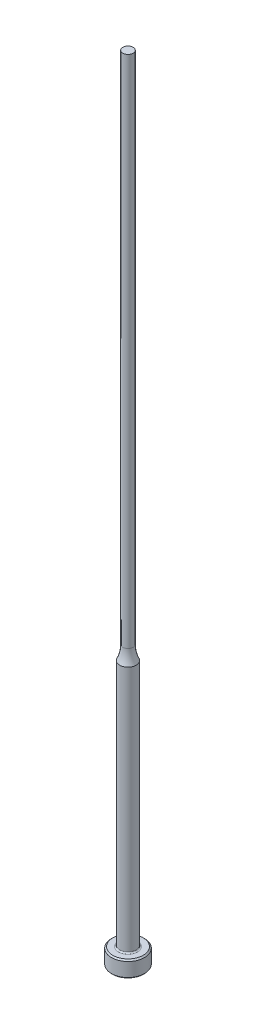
ISO-10303-21;
HEADER;
FILE_DESCRIPTION(('STEP AP214'),'2;1');
FILE_NAME('part.step','',(''),(''),'','','');
FILE_SCHEMA(('AUTOMOTIVE_DESIGN { 1 0 10303 214 1 1 1 1 }'));
ENDSEC;
DATA;
#1=APPLICATION_CONTEXT('core data for automotive mechanical design processes');
#2=APPLICATION_PROTOCOL_DEFINITION('international standard','automotive_design',2000,#1);
#3=PRODUCT_CONTEXT('',#1,'mechanical');
#4=PRODUCT('Part','Part','',(#3));
#5=PRODUCT_RELATED_PRODUCT_CATEGORY('part','',(#4));
#6=PRODUCT_DEFINITION_FORMATION('','',#4);
#7=PRODUCT_DEFINITION_CONTEXT('part definition',#1,'design');
#8=PRODUCT_DEFINITION('design','',#6,#7);
#9=PRODUCT_DEFINITION_SHAPE('','',#8);
#10=(LENGTH_UNIT() NAMED_UNIT(*) SI_UNIT(.MILLI.,.METRE.));
#11=(NAMED_UNIT(*) PLANE_ANGLE_UNIT() SI_UNIT($,.RADIAN.));
#12=(NAMED_UNIT(*) SI_UNIT($,.STERADIAN.) SOLID_ANGLE_UNIT());
#13=UNCERTAINTY_MEASURE_WITH_UNIT(LENGTH_MEASURE(1.E-05),#10,'distance_accuracy_value','');
#14=(GEOMETRIC_REPRESENTATION_CONTEXT(3) GLOBAL_UNCERTAINTY_ASSIGNED_CONTEXT((#13)) GLOBAL_UNIT_ASSIGNED_CONTEXT((#10,
#11,#12)) REPRESENTATION_CONTEXT('',''));
#15=CARTESIAN_POINT('',(0.,0.,0.));
#16=DIRECTION('',(0.,0.,1.));
#17=DIRECTION('',(1.,0.,0.));
#18=AXIS2_PLACEMENT_3D('',#15,#16,#17);
#19=CARTESIAN_POINT('',(-0.991869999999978,152.4,0.));
#20=DIRECTION('',(0.,1.,0.));
#21=DIRECTION('',(0.,0.,1.));
#22=AXIS2_PLACEMENT_3D('',#19,#20,#21);
#23=PLANE('',#22);
#24=CARTESIAN_POINT('',(0.,152.4,0.));
#25=DIRECTION('',(0.,1.,0.));
#26=DIRECTION('',(0.,0.,1.));
#27=AXIS2_PLACEMENT_3D('',#24,#25,#26);
#28=CIRCLE('',#27,0.991869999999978);
#29=CARTESIAN_POINT('',(0.,152.4,0.991869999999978));
#30=VERTEX_POINT('',#29);
#31=EDGE_CURVE('E61',#30,#30,#28,.T.);
#32=ORIENTED_EDGE('',*,*,#31,.T.);
#33=EDGE_LOOP('',(#32));
#34=FACE_BOUND('',#33,.T.);
#35=ADVANCED_FACE('F35',(#34),#23,.T.);
#36=CARTESIAN_POINT('',(0.,259.958771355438,0.));
#37=DIRECTION('',(0.,1.,0.));
#38=DIRECTION('',(0.,0.,1.));
#39=AXIS2_PLACEMENT_3D('',#36,#37,#38);
#40=CYLINDRICAL_SURFACE('',#39,0.991869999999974);
#41=CARTESIAN_POINT('',(0.,53.4850932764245,0.));
#42=DIRECTION('',(0.,1.,0.));
#43=DIRECTION('',(0.,0.,1.));
#44=AXIS2_PLACEMENT_3D('',#41,#42,#43);
#45=CIRCLE('',#44,0.991869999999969);
#46=CARTESIAN_POINT('',(0.,53.4850932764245,0.991869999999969));
#47=VERTEX_POINT('',#46);
#48=EDGE_CURVE('E64',#47,#47,#45,.T.);
#49=ORIENTED_EDGE('',*,*,#48,.T.);
#50=EDGE_LOOP('',(#49));
#51=FACE_BOUND('',#50,.T.);
#52=ORIENTED_EDGE('',*,*,#31,.F.);
#53=EDGE_LOOP('',(#52));
#54=FACE_BOUND('',#53,.T.);
#55=ADVANCED_FACE('F84',(#51,#54),#40,.T.);
#56=CARTESIAN_POINT('',(0.,53.4850932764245,0.));
#57=DIRECTION('',(0.,1.,0.));
#58=DIRECTION('',(0.,0.,1.));
#59=AXIS2_PLACEMENT_3D('',#56,#57,#58);
#60=TOROIDAL_SURFACE('',#59,7.34186999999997,6.35);
#61=CARTESIAN_POINT('',(0.,50.8,0.));
#62=DIRECTION('',(0.,1.,0.));
#63=DIRECTION('',(0.,0.,1.));
#64=AXIS2_PLACEMENT_3D('',#61,#62,#63);
#65=CIRCLE('',#64,1.58749999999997);
#66=CARTESIAN_POINT('',(0.,50.8,1.58749999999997));
#67=VERTEX_POINT('',#66);
#68=EDGE_CURVE('E67',#67,#67,#65,.T.);
#69=ORIENTED_EDGE('',*,*,#68,.T.);
#70=EDGE_LOOP('',(#69));
#71=FACE_BOUND('',#70,.T.);
#72=ORIENTED_EDGE('',*,*,#48,.F.);
#73=EDGE_LOOP('',(#72));
#74=FACE_BOUND('',#73,.T.);
#75=ADVANCED_FACE('F71',(#71,#74),#60,.F.);
#76=CARTESIAN_POINT('',(0.,259.958771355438,0.));
#77=DIRECTION('',(0.,1.,0.));
#78=DIRECTION('',(0.,0.,1.));
#79=AXIS2_PLACEMENT_3D('',#76,#77,#78);
#80=CYLINDRICAL_SURFACE('',#79,1.58749999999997);
#81=CARTESIAN_POINT('',(0.,3.42900000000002,0.));
#82=DIRECTION('',(0.,1.,0.));
#83=DIRECTION('',(0.,0.,1.));
#84=AXIS2_PLACEMENT_3D('',#81,#82,#83);
#85=CIRCLE('',#84,1.58749999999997);
#86=CARTESIAN_POINT('',(0.,3.42900000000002,1.58749999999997));
#87=VERTEX_POINT('',#86);
#88=EDGE_CURVE('E42',#87,#87,#85,.T.);
#89=ORIENTED_EDGE('',*,*,#88,.T.);
#90=EDGE_LOOP('',(#89));
#91=FACE_BOUND('',#90,.T.);
#92=ORIENTED_EDGE('',*,*,#68,.F.);
#93=EDGE_LOOP('',(#92));
#94=FACE_BOUND('',#93,.T.);
#95=ADVANCED_FACE('F74',(#91,#94),#80,.T.);
#96=CARTESIAN_POINT('',(-3.17499999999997,3.175,0.));
#97=DIRECTION('',(0.,1.,0.));
#98=DIRECTION('',(0.,0.,1.));
#99=AXIS2_PLACEMENT_3D('',#96,#97,#98);
#100=PLANE('',#99);
#101=CARTESIAN_POINT('',(0.,3.175,0.));
#102=DIRECTION('',(0.,1.,0.));
#103=DIRECTION('',(0.,0.,1.));
#104=AXIS2_PLACEMENT_3D('',#101,#102,#103);
#105=CIRCLE('',#104,1.84149999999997);
#106=CARTESIAN_POINT('',(0.,3.175,1.84149999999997));
#107=VERTEX_POINT('',#106);
#108=EDGE_CURVE('E10',#107,#107,#105,.F.);
#109=ORIENTED_EDGE('',*,*,#108,.T.);
#110=EDGE_LOOP('',(#109));
#111=FACE_BOUND('',#110,.T.);
#112=CARTESIAN_POINT('',(0.,3.175,0.));
#113=DIRECTION('',(0.,1.,0.));
#114=DIRECTION('',(0.,0.,1.));
#115=AXIS2_PLACEMENT_3D('',#112,#113,#114);
#116=CIRCLE('',#115,2.92099999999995);
#117=CARTESIAN_POINT('',(0.,3.175,2.92099999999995));
#118=VERTEX_POINT('',#117);
#119=EDGE_CURVE('E58',#118,#118,#116,.T.);
#120=ORIENTED_EDGE('',*,*,#119,.T.);
#121=EDGE_LOOP('',(#120));
#122=FACE_BOUND('',#121,.T.);
#123=ADVANCED_FACE('F76',(#111,#122),#100,.T.);
#124=CARTESIAN_POINT('',(0.,259.958771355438,0.));
#125=DIRECTION('',(0.,1.,0.));
#126=DIRECTION('',(0.,0.,1.));
#127=AXIS2_PLACEMENT_3D('',#124,#125,#126);
#128=CYLINDRICAL_SURFACE('',#127,3.17499999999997);
#129=CARTESIAN_POINT('',(0.,2.92100000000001,0.));
#130=DIRECTION('',(0.,1.,0.));
#131=DIRECTION('',(0.,0.,1.));
#132=AXIS2_PLACEMENT_3D('',#129,#130,#131);
#133=CIRCLE('',#132,3.17499999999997);
#134=CARTESIAN_POINT('',(0.,2.92100000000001,3.17499999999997));
#135=VERTEX_POINT('',#134);
#136=EDGE_CURVE('E50',#135,#135,#133,.F.);
#137=ORIENTED_EDGE('',*,*,#136,.T.);
#138=EDGE_LOOP('',(#137));
#139=FACE_BOUND('',#138,.T.);
#140=CARTESIAN_POINT('',(0.,0.254000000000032,0.));
#141=DIRECTION('',(0.,-1.,0.));
#142=DIRECTION('',(0.,0.,-1.));
#143=AXIS2_PLACEMENT_3D('',#140,#141,#142);
#144=CIRCLE('',#143,3.17499999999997);
#145=CARTESIAN_POINT('',(0.,0.254000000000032,-3.17499999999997));
#146=VERTEX_POINT('',#145);
#147=EDGE_CURVE('E55',#146,#146,#144,.F.);
#148=ORIENTED_EDGE('',*,*,#147,.T.);
#149=EDGE_LOOP('',(#148));
#150=FACE_BOUND('',#149,.T.);
#151=ADVANCED_FACE('F82',(#139,#150),#128,.T.);
#152=CARTESIAN_POINT('',(0.,0.,0.));
#153=DIRECTION('',(0.,-1.,0.));
#154=DIRECTION('',(0.,0.,-1.));
#155=AXIS2_PLACEMENT_3D('',#152,#153,#154);
#156=PLANE('',#155);
#157=CARTESIAN_POINT('',(0.,0.,0.));
#158=DIRECTION('',(0.,-1.,0.));
#159=DIRECTION('',(0.,0.,-1.));
#160=AXIS2_PLACEMENT_3D('',#157,#158,#159);
#161=CIRCLE('',#160,2.92099999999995);
#162=CARTESIAN_POINT('',(0.,0.,-2.92099999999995));
#163=VERTEX_POINT('',#162);
#164=EDGE_CURVE('E46',#163,#163,#161,.T.);
#165=ORIENTED_EDGE('',*,*,#164,.T.);
#166=EDGE_LOOP('',(#165));
#167=FACE_BOUND('',#166,.T.);
#168=ADVANCED_FACE('F98',(#167),#156,.T.);
#169=CARTESIAN_POINT('',(0.,3.17499999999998,0.));
#170=DIRECTION('',(0.,-1.,0.));
#171=DIRECTION('',(0.,0.,-1.));
#172=AXIS2_PLACEMENT_3D('',#169,#170,#171);
#173=CONICAL_SURFACE('',#172,2.92099999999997,0.7853981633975);
#174=ORIENTED_EDGE('',*,*,#136,.F.);
#175=EDGE_LOOP('',(#174));
#176=FACE_BOUND('',#175,.T.);
#177=ORIENTED_EDGE('',*,*,#119,.F.);
#178=EDGE_LOOP('',(#177));
#179=FACE_BOUND('',#178,.T.);
#180=ADVANCED_FACE('F95',(#176,#179),#173,.T.);
#181=CARTESIAN_POINT('',(0.,0.254000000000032,0.));
#182=DIRECTION('',(0.,1.,0.));
#183=DIRECTION('',(0.,0.,1.));
#184=AXIS2_PLACEMENT_3D('',#181,#182,#183);
#185=CONICAL_SURFACE('',#184,3.17499999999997,0.785398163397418);
#186=ORIENTED_EDGE('',*,*,#164,.F.);
#187=EDGE_LOOP('',(#186));
#188=FACE_BOUND('',#187,.T.);
#189=ORIENTED_EDGE('',*,*,#147,.F.);
#190=EDGE_LOOP('',(#189));
#191=FACE_BOUND('',#190,.T.);
#192=ADVANCED_FACE('F97',(#188,#191),#185,.T.);
#193=CARTESIAN_POINT('',(0.,3.42900000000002,0.));
#194=DIRECTION('',(0.,1.,0.));
#195=DIRECTION('',(0.,0.,1.));
#196=AXIS2_PLACEMENT_3D('',#193,#194,#195);
#197=TOROIDAL_SURFACE('',#196,1.84149999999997,0.254);
#198=ORIENTED_EDGE('',*,*,#108,.F.);
#199=EDGE_LOOP('',(#198));
#200=FACE_BOUND('',#199,.T.);
#201=ORIENTED_EDGE('',*,*,#88,.F.);
#202=EDGE_LOOP('',(#201));
#203=FACE_BOUND('',#202,.T.);
#204=ADVANCED_FACE('F37',(#200,#203),#197,.F.);
#205=CLOSED_SHELL('',(#35,#55,#75,#95,#123,#151,#168,#180,#192,#204));
#206=MANIFOLD_SOLID_BREP('B2',#205);
#207=ADVANCED_BREP_SHAPE_REPRESENTATION('',(#18,#206),#14);
#208=SHAPE_DEFINITION_REPRESENTATION(#9,#207);
ENDSEC;
END-ISO-10303-21;
